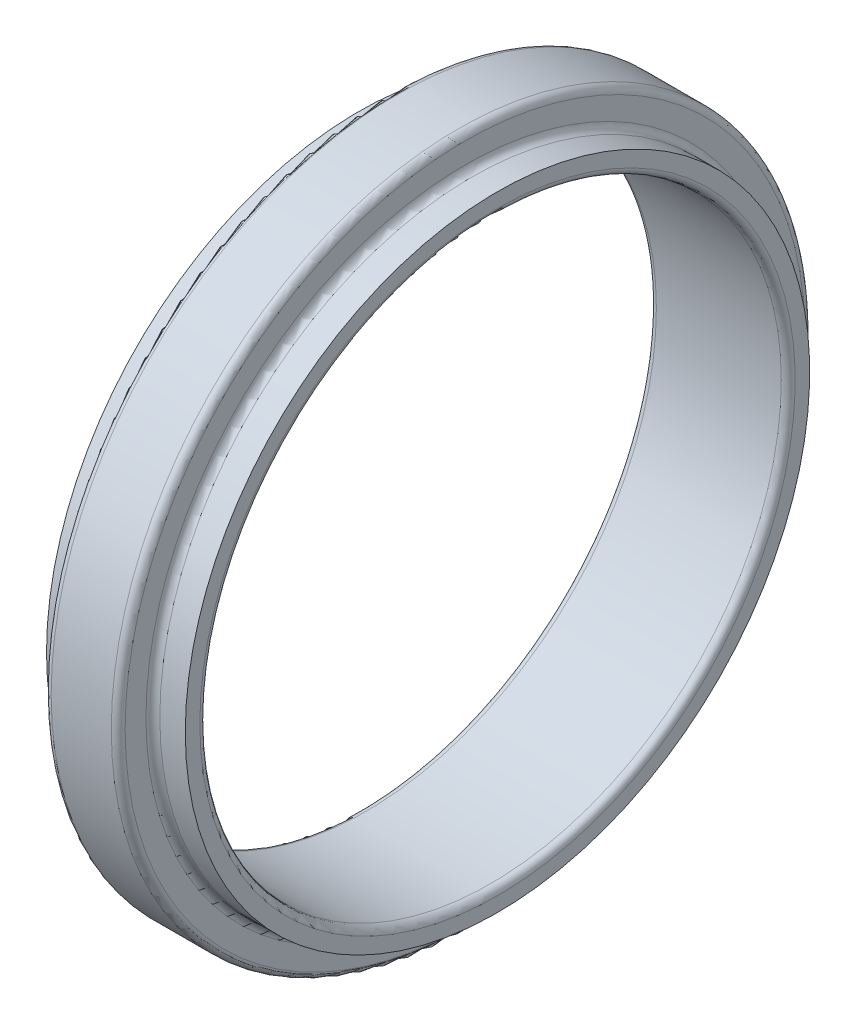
ISO-10303-21;
HEADER;
FILE_DESCRIPTION(('STEP AP214'),'2;1');
FILE_NAME('part.step','',(''),(''),'','','');
FILE_SCHEMA(('AUTOMOTIVE_DESIGN { 1 0 10303 214 1 1 1 1 }'));
ENDSEC;
DATA;
#1=APPLICATION_CONTEXT('core data for automotive mechanical design processes');
#2=APPLICATION_PROTOCOL_DEFINITION('international standard','automotive_design',2000,#1);
#3=PRODUCT_CONTEXT('',#1,'mechanical');
#4=PRODUCT('Part','Part','',(#3));
#5=PRODUCT_RELATED_PRODUCT_CATEGORY('part','',(#4));
#6=PRODUCT_DEFINITION_FORMATION('','',#4);
#7=PRODUCT_DEFINITION_CONTEXT('part definition',#1,'design');
#8=PRODUCT_DEFINITION('design','',#6,#7);
#9=PRODUCT_DEFINITION_SHAPE('','',#8);
#10=(LENGTH_UNIT() NAMED_UNIT(*) SI_UNIT(.MILLI.,.METRE.));
#11=(NAMED_UNIT(*) PLANE_ANGLE_UNIT() SI_UNIT($,.RADIAN.));
#12=(NAMED_UNIT(*) SI_UNIT($,.STERADIAN.) SOLID_ANGLE_UNIT());
#13=UNCERTAINTY_MEASURE_WITH_UNIT(LENGTH_MEASURE(1.E-05),#10,'distance_accuracy_value','');
#14=(GEOMETRIC_REPRESENTATION_CONTEXT(3) GLOBAL_UNCERTAINTY_ASSIGNED_CONTEXT((#13)) GLOBAL_UNIT_ASSIGNED_CONTEXT((#10,
#11,#12)) REPRESENTATION_CONTEXT('',''));
#15=CARTESIAN_POINT('',(0.,0.,0.));
#16=DIRECTION('',(0.,0.,1.));
#17=DIRECTION('',(1.,0.,0.));
#18=AXIS2_PLACEMENT_3D('',#15,#16,#17);
#19=CARTESIAN_POINT('',(3.81,17.145,0.));
#20=DIRECTION('',(-1.,0.,0.));
#21=DIRECTION('',(0.,0.,1.));
#22=AXIS2_PLACEMENT_3D('',#19,#20,#21);
#23=PLANE('',#22);
#24=CARTESIAN_POINT('',(3.81,0.,0.));
#25=DIRECTION('',(-1.,0.,0.));
#26=DIRECTION('',(0.,0.,1.));
#27=AXIS2_PLACEMENT_3D('',#24,#25,#26);
#28=CIRCLE('',#27,17.145);
#29=CARTESIAN_POINT('',(3.81,0.,17.145));
#30=VERTEX_POINT('',#29);
#31=EDGE_CURVE('E10',#30,#30,#28,.T.);
#32=ORIENTED_EDGE('',*,*,#31,.F.);
#33=EDGE_LOOP('',(#32));
#34=FACE_BOUND('',#33,.T.);
#35=CARTESIAN_POINT('',(3.81,0.,0.));
#36=DIRECTION('',(-1.,0.,0.));
#37=DIRECTION('',(0.,0.,1.));
#38=AXIS2_PLACEMENT_3D('',#35,#36,#37);
#39=CIRCLE('',#38,16.3449);
#40=CARTESIAN_POINT('',(3.81,0.,16.3449));
#41=VERTEX_POINT('',#40);
#42=EDGE_CURVE('E72',#41,#41,#39,.T.);
#43=ORIENTED_EDGE('',*,*,#42,.T.);
#44=EDGE_LOOP('',(#43));
#45=FACE_BOUND('',#44,.T.);
#46=ADVANCED_FACE('F26',(#34,#45),#23,.F.);
#47=CARTESIAN_POINT('',(0.,0.,0.));
#48=DIRECTION('',(-1.,0.,0.));
#49=DIRECTION('',(0.,0.,1.));
#50=AXIS2_PLACEMENT_3D('',#47,#48,#49);
#51=CYLINDRICAL_SURFACE('',#50,17.145);
#52=CARTESIAN_POINT('',(2.413,0.,0.));
#53=DIRECTION('',(-1.,0.,0.));
#54=DIRECTION('',(0.,0.,1.));
#55=AXIS2_PLACEMENT_3D('',#52,#53,#54);
#56=CIRCLE('',#55,17.145);
#57=CARTESIAN_POINT('',(2.413,0.,17.145));
#58=VERTEX_POINT('',#57);
#59=EDGE_CURVE('E32',#58,#58,#56,.T.);
#60=ORIENTED_EDGE('',*,*,#59,.F.);
#61=EDGE_LOOP('',(#60));
#62=FACE_BOUND('',#61,.T.);
#63=ORIENTED_EDGE('',*,*,#31,.T.);
#64=EDGE_LOOP('',(#63));
#65=FACE_BOUND('',#64,.T.);
#66=ADVANCED_FACE('F145',(#62,#65),#51,.T.);
#67=CARTESIAN_POINT('',(2.413,0.,0.));
#68=DIRECTION('',(-1.,0.,0.));
#69=DIRECTION('',(0.,0.,1.));
#70=AXIS2_PLACEMENT_3D('',#67,#68,#69);
#71=TOROIDAL_SURFACE('',#70,17.526,0.381);
#72=CARTESIAN_POINT('',(2.032,0.,0.));
#73=DIRECTION('',(-1.,0.,0.));
#74=DIRECTION('',(0.,0.,1.));
#75=AXIS2_PLACEMENT_3D('',#72,#73,#74);
#76=CIRCLE('',#75,17.526);
#77=CARTESIAN_POINT('',(2.032,0.,17.526));
#78=VERTEX_POINT('',#77);
#79=EDGE_CURVE('E36',#78,#78,#76,.T.);
#80=ORIENTED_EDGE('',*,*,#79,.F.);
#81=EDGE_LOOP('',(#80));
#82=FACE_BOUND('',#81,.T.);
#83=ORIENTED_EDGE('',*,*,#59,.T.);
#84=EDGE_LOOP('',(#83));
#85=FACE_BOUND('',#84,.T.);
#86=ADVANCED_FACE('F140',(#82,#85),#71,.F.);
#87=CARTESIAN_POINT('',(2.032,18.669,0.));
#88=DIRECTION('',(-1.,0.,0.));
#89=DIRECTION('',(0.,0.,1.));
#90=AXIS2_PLACEMENT_3D('',#87,#88,#89);
#91=PLANE('',#90);
#92=CARTESIAN_POINT('',(2.032,0.,0.));
#93=DIRECTION('',(-1.,0.,0.));
#94=DIRECTION('',(0.,0.,1.));
#95=AXIS2_PLACEMENT_3D('',#92,#93,#94);
#96=CIRCLE('',#95,18.669);
#97=CARTESIAN_POINT('',(2.032,0.,18.669));
#98=VERTEX_POINT('',#97);
#99=EDGE_CURVE('E40',#98,#98,#96,.T.);
#100=ORIENTED_EDGE('',*,*,#99,.F.);
#101=EDGE_LOOP('',(#100));
#102=FACE_BOUND('',#101,.T.);
#103=ORIENTED_EDGE('',*,*,#79,.T.);
#104=EDGE_LOOP('',(#103));
#105=FACE_BOUND('',#104,.T.);
#106=ADVANCED_FACE('F134',(#102,#105),#91,.F.);
#107=CARTESIAN_POINT('',(1.651,0.,0.));
#108=DIRECTION('',(-1.,0.,0.));
#109=DIRECTION('',(0.,0.,1.));
#110=AXIS2_PLACEMENT_3D('',#107,#108,#109);
#111=TOROIDAL_SURFACE('',#110,18.669,0.381);
#112=CARTESIAN_POINT('',(1.651,0.,0.));
#113=DIRECTION('',(-1.,0.,0.));
#114=DIRECTION('',(0.,0.,1.));
#115=AXIS2_PLACEMENT_3D('',#112,#113,#114);
#116=CIRCLE('',#115,19.05);
#117=CARTESIAN_POINT('',(1.651,0.,19.05));
#118=VERTEX_POINT('',#117);
#119=EDGE_CURVE('E45',#118,#118,#116,.T.);
#120=ORIENTED_EDGE('',*,*,#119,.F.);
#121=EDGE_LOOP('',(#120));
#122=FACE_BOUND('',#121,.T.);
#123=ORIENTED_EDGE('',*,*,#99,.T.);
#124=EDGE_LOOP('',(#123));
#125=FACE_BOUND('',#124,.T.);
#126=ADVANCED_FACE('F128',(#122,#125),#111,.T.);
#127=CARTESIAN_POINT('',(0.,0.,0.));
#128=DIRECTION('',(-1.,0.,0.));
#129=DIRECTION('',(0.,0.,1.));
#130=AXIS2_PLACEMENT_3D('',#127,#128,#129);
#131=CYLINDRICAL_SURFACE('',#130,19.05);
#132=CARTESIAN_POINT('',(-1.651,0.,0.));
#133=DIRECTION('',(-1.,0.,0.));
#134=DIRECTION('',(0.,0.,1.));
#135=AXIS2_PLACEMENT_3D('',#132,#133,#134);
#136=CIRCLE('',#135,19.05);
#137=CARTESIAN_POINT('',(-1.651,0.,19.05));
#138=VERTEX_POINT('',#137);
#139=EDGE_CURVE('E48',#138,#138,#136,.T.);
#140=ORIENTED_EDGE('',*,*,#139,.F.);
#141=EDGE_LOOP('',(#140));
#142=FACE_BOUND('',#141,.T.);
#143=ORIENTED_EDGE('',*,*,#119,.T.);
#144=EDGE_LOOP('',(#143));
#145=FACE_BOUND('',#144,.T.);
#146=ADVANCED_FACE('F122',(#142,#145),#131,.T.);
#147=CARTESIAN_POINT('',(-1.651,0.,0.));
#148=DIRECTION('',(-1.,0.,0.));
#149=DIRECTION('',(0.,0.,1.));
#150=AXIS2_PLACEMENT_3D('',#147,#148,#149);
#151=TOROIDAL_SURFACE('',#150,18.669,0.381);
#152=CARTESIAN_POINT('',(-2.032,0.,0.));
#153=DIRECTION('',(-1.,0.,0.));
#154=DIRECTION('',(0.,0.,1.));
#155=AXIS2_PLACEMENT_3D('',#152,#153,#154);
#156=CIRCLE('',#155,18.669);
#157=CARTESIAN_POINT('',(-2.032,0.,18.669));
#158=VERTEX_POINT('',#157);
#159=EDGE_CURVE('E51',#158,#158,#156,.T.);
#160=ORIENTED_EDGE('',*,*,#159,.F.);
#161=EDGE_LOOP('',(#160));
#162=FACE_BOUND('',#161,.T.);
#163=ORIENTED_EDGE('',*,*,#139,.T.);
#164=EDGE_LOOP('',(#163));
#165=FACE_BOUND('',#164,.T.);
#166=ADVANCED_FACE('F116',(#162,#165),#151,.T.);
#167=CARTESIAN_POINT('',(-2.032,18.669,0.));
#168=DIRECTION('',(1.,0.,0.));
#169=DIRECTION('',(0.,0.,-1.));
#170=AXIS2_PLACEMENT_3D('',#167,#168,#169);
#171=PLANE('',#170);
#172=CARTESIAN_POINT('',(-2.032,0.,0.));
#173=DIRECTION('',(-1.,0.,0.));
#174=DIRECTION('',(0.,0.,1.));
#175=AXIS2_PLACEMENT_3D('',#172,#173,#174);
#176=CIRCLE('',#175,17.526);
#177=CARTESIAN_POINT('',(-2.032,0.,17.526));
#178=VERTEX_POINT('',#177);
#179=EDGE_CURVE('E54',#178,#178,#176,.T.);
#180=ORIENTED_EDGE('',*,*,#179,.F.);
#181=EDGE_LOOP('',(#180));
#182=FACE_BOUND('',#181,.T.);
#183=ORIENTED_EDGE('',*,*,#159,.T.);
#184=EDGE_LOOP('',(#183));
#185=FACE_BOUND('',#184,.T.);
#186=ADVANCED_FACE('F110',(#182,#185),#171,.F.);
#187=CARTESIAN_POINT('',(-2.413,0.,0.));
#188=DIRECTION('',(-1.,0.,0.));
#189=DIRECTION('',(0.,0.,1.));
#190=AXIS2_PLACEMENT_3D('',#187,#188,#189);
#191=TOROIDAL_SURFACE('',#190,17.526,0.381);
#192=CARTESIAN_POINT('',(-2.413,0.,0.));
#193=DIRECTION('',(-1.,0.,0.));
#194=DIRECTION('',(0.,0.,1.));
#195=AXIS2_PLACEMENT_3D('',#192,#193,#194);
#196=CIRCLE('',#195,17.145);
#197=CARTESIAN_POINT('',(-2.413,0.,17.145));
#198=VERTEX_POINT('',#197);
#199=EDGE_CURVE('E57',#198,#198,#196,.T.);
#200=ORIENTED_EDGE('',*,*,#199,.F.);
#201=EDGE_LOOP('',(#200));
#202=FACE_BOUND('',#201,.T.);
#203=ORIENTED_EDGE('',*,*,#179,.T.);
#204=EDGE_LOOP('',(#203));
#205=FACE_BOUND('',#204,.T.);
#206=ADVANCED_FACE('F104',(#202,#205),#191,.F.);
#207=CARTESIAN_POINT('',(0.,0.,0.));
#208=DIRECTION('',(-1.,0.,0.));
#209=DIRECTION('',(0.,0.,1.));
#210=AXIS2_PLACEMENT_3D('',#207,#208,#209);
#211=CYLINDRICAL_SURFACE('',#210,17.145);
#212=CARTESIAN_POINT('',(-3.81,0.,0.));
#213=DIRECTION('',(-1.,0.,0.));
#214=DIRECTION('',(0.,0.,1.));
#215=AXIS2_PLACEMENT_3D('',#212,#213,#214);
#216=CIRCLE('',#215,17.145);
#217=CARTESIAN_POINT('',(-3.81,0.,17.145));
#218=VERTEX_POINT('',#217);
#219=EDGE_CURVE('E60',#218,#218,#216,.T.);
#220=ORIENTED_EDGE('',*,*,#219,.F.);
#221=EDGE_LOOP('',(#220));
#222=FACE_BOUND('',#221,.T.);
#223=ORIENTED_EDGE('',*,*,#199,.T.);
#224=EDGE_LOOP('',(#223));
#225=FACE_BOUND('',#224,.T.);
#226=ADVANCED_FACE('F98',(#222,#225),#211,.T.);
#227=CARTESIAN_POINT('',(-3.81,17.145,0.));
#228=DIRECTION('',(1.,0.,0.));
#229=DIRECTION('',(0.,0.,-1.));
#230=AXIS2_PLACEMENT_3D('',#227,#228,#229);
#231=PLANE('',#230);
#232=CARTESIAN_POINT('',(-3.81,0.,0.));
#233=DIRECTION('',(-1.,0.,0.));
#234=DIRECTION('',(0.,0.,1.));
#235=AXIS2_PLACEMENT_3D('',#232,#233,#234);
#236=CIRCLE('',#235,16.3449);
#237=CARTESIAN_POINT('',(-3.81,0.,16.3449));
#238=VERTEX_POINT('',#237);
#239=EDGE_CURVE('E63',#238,#238,#236,.T.);
#240=ORIENTED_EDGE('',*,*,#239,.F.);
#241=EDGE_LOOP('',(#240));
#242=FACE_BOUND('',#241,.T.);
#243=ORIENTED_EDGE('',*,*,#219,.T.);
#244=EDGE_LOOP('',(#243));
#245=FACE_BOUND('',#244,.T.);
#246=ADVANCED_FACE('F92',(#242,#245),#231,.F.);
#247=CARTESIAN_POINT('',(-3.429,0.,0.));
#248=DIRECTION('',(-1.,0.,0.));
#249=DIRECTION('',(0.,0.,1.));
#250=AXIS2_PLACEMENT_3D('',#247,#248,#249);
#251=TOROIDAL_SURFACE('',#250,16.3449,0.381);
#252=CARTESIAN_POINT('',(-3.429,0.,0.));
#253=DIRECTION('',(-1.,0.,0.));
#254=DIRECTION('',(0.,0.,1.));
#255=AXIS2_PLACEMENT_3D('',#252,#253,#254);
#256=CIRCLE('',#255,15.9639);
#257=CARTESIAN_POINT('',(-3.429,0.,15.9639));
#258=VERTEX_POINT('',#257);
#259=EDGE_CURVE('E66',#258,#258,#256,.T.);
#260=ORIENTED_EDGE('',*,*,#259,.F.);
#261=EDGE_LOOP('',(#260));
#262=FACE_BOUND('',#261,.T.);
#263=ORIENTED_EDGE('',*,*,#239,.T.);
#264=EDGE_LOOP('',(#263));
#265=FACE_BOUND('',#264,.T.);
#266=ADVANCED_FACE('F86',(#262,#265),#251,.T.);
#267=CARTESIAN_POINT('',(0.,0.,0.));
#268=DIRECTION('',(-1.,0.,0.));
#269=DIRECTION('',(0.,0.,1.));
#270=AXIS2_PLACEMENT_3D('',#267,#268,#269);
#271=CYLINDRICAL_SURFACE('',#270,15.9639);
#272=CARTESIAN_POINT('',(3.429,0.,0.));
#273=DIRECTION('',(-1.,0.,0.));
#274=DIRECTION('',(0.,0.,1.));
#275=AXIS2_PLACEMENT_3D('',#272,#273,#274);
#276=CIRCLE('',#275,15.9639);
#277=CARTESIAN_POINT('',(3.429,0.,15.9639));
#278=VERTEX_POINT('',#277);
#279=EDGE_CURVE('E69',#278,#278,#276,.T.);
#280=ORIENTED_EDGE('',*,*,#279,.F.);
#281=EDGE_LOOP('',(#280));
#282=FACE_BOUND('',#281,.T.);
#283=ORIENTED_EDGE('',*,*,#259,.T.);
#284=EDGE_LOOP('',(#283));
#285=FACE_BOUND('',#284,.T.);
#286=ADVANCED_FACE('F80',(#282,#285),#271,.F.);
#287=CARTESIAN_POINT('',(3.429,0.,0.));
#288=DIRECTION('',(-1.,0.,0.));
#289=DIRECTION('',(0.,0.,1.));
#290=AXIS2_PLACEMENT_3D('',#287,#288,#289);
#291=TOROIDAL_SURFACE('',#290,16.3449,0.381);
#292=ORIENTED_EDGE('',*,*,#42,.F.);
#293=EDGE_LOOP('',(#292));
#294=FACE_BOUND('',#293,.T.);
#295=ORIENTED_EDGE('',*,*,#279,.T.);
#296=EDGE_LOOP('',(#295));
#297=FACE_BOUND('',#296,.T.);
#298=ADVANCED_FACE('F77',(#294,#297),#291,.T.);
#299=CLOSED_SHELL('',(#46,#66,#86,#106,#126,#146,#166,#186,#206,#226,#246,#266,#286,#298));
#300=MANIFOLD_SOLID_BREP('B2',#299);
#301=ADVANCED_BREP_SHAPE_REPRESENTATION('',(#18,#300),#14);
#302=SHAPE_DEFINITION_REPRESENTATION(#9,#301);
ENDSEC;
END-ISO-10303-21;
